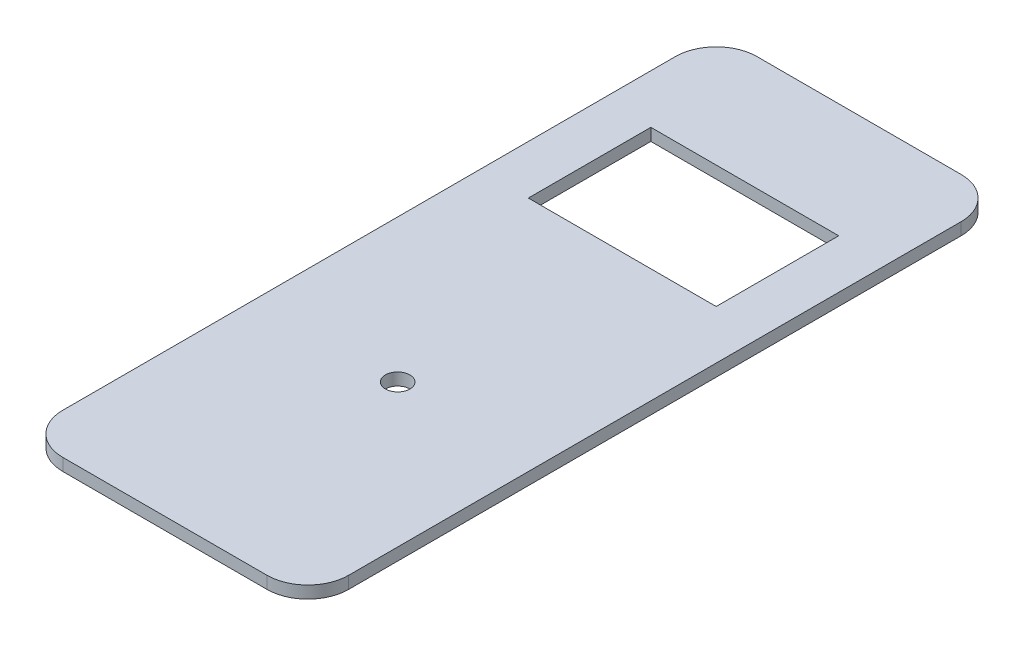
ISO-10303-21;
HEADER;
FILE_DESCRIPTION(('STEP AP214'),'2;1');
FILE_NAME('part.step','',(''),(''),'','','');
FILE_SCHEMA(('AUTOMOTIVE_DESIGN { 1 0 10303 214 1 1 1 1 }'));
ENDSEC;
DATA;
#1=APPLICATION_CONTEXT('core data for automotive mechanical design processes');
#2=APPLICATION_PROTOCOL_DEFINITION('international standard','automotive_design',2000,#1);
#3=PRODUCT_CONTEXT('',#1,'mechanical');
#4=PRODUCT('Part','Part','',(#3));
#5=PRODUCT_RELATED_PRODUCT_CATEGORY('part','',(#4));
#6=PRODUCT_DEFINITION_FORMATION('','',#4);
#7=PRODUCT_DEFINITION_CONTEXT('part definition',#1,'design');
#8=PRODUCT_DEFINITION('design','',#6,#7);
#9=PRODUCT_DEFINITION_SHAPE('','',#8);
#10=(LENGTH_UNIT() NAMED_UNIT(*) SI_UNIT(.MILLI.,.METRE.));
#11=(NAMED_UNIT(*) PLANE_ANGLE_UNIT() SI_UNIT($,.RADIAN.));
#12=(NAMED_UNIT(*) SI_UNIT($,.STERADIAN.) SOLID_ANGLE_UNIT());
#13=UNCERTAINTY_MEASURE_WITH_UNIT(LENGTH_MEASURE(1.E-05),#10,'distance_accuracy_value','');
#14=(GEOMETRIC_REPRESENTATION_CONTEXT(3) GLOBAL_UNCERTAINTY_ASSIGNED_CONTEXT((#13)) GLOBAL_UNIT_ASSIGNED_CONTEXT((#10,
#11,#12)) REPRESENTATION_CONTEXT('',''));
#15=CARTESIAN_POINT('',(0.,0.,0.));
#16=DIRECTION('',(0.,0.,1.));
#17=DIRECTION('',(1.,0.,0.));
#18=AXIS2_PLACEMENT_3D('',#15,#16,#17);
#19=CARTESIAN_POINT('',(0.,1.5,0.));
#20=DIRECTION('',(0.,1.,0.));
#21=DIRECTION('',(0.,0.,1.));
#22=AXIS2_PLACEMENT_3D('',#19,#20,#21);
#23=PLANE('',#22);
#24=DIRECTION('',(1.,0.,0.));
#25=VECTOR('',#24,1.);
#26=CARTESIAN_POINT('',(-11.5,1.5,29.));
#27=LINE('',#26,#25);
#28=CARTESIAN_POINT('',(-11.5,1.5,29.));
#29=VERTEX_POINT('',#28);
#30=CARTESIAN_POINT('',(11.5,1.5,29.));
#31=VERTEX_POINT('',#30);
#32=EDGE_CURVE('E134',#29,#31,#27,.T.);
#33=ORIENTED_EDGE('',*,*,#32,.F.);
#34=DIRECTION('',(0.,0.,1.));
#35=VECTOR('',#34,1.);
#36=CARTESIAN_POINT('',(-11.5,1.5,14.));
#37=LINE('',#36,#35);
#38=CARTESIAN_POINT('',(-11.5,1.5,14.));
#39=VERTEX_POINT('',#38);
#40=EDGE_CURVE('E124',#39,#29,#37,.T.);
#41=ORIENTED_EDGE('',*,*,#40,.F.);
#42=DIRECTION('',(-1.,0.,0.));
#43=VECTOR('',#42,1.);
#44=CARTESIAN_POINT('',(-11.5,1.5,14.));
#45=LINE('',#44,#43);
#46=CARTESIAN_POINT('',(11.5,1.5,14.));
#47=VERTEX_POINT('',#46);
#48=EDGE_CURVE('E149',#47,#39,#45,.T.);
#49=ORIENTED_EDGE('',*,*,#48,.F.);
#50=DIRECTION('',(0.,0.,-1.));
#51=VECTOR('',#50,1.);
#52=CARTESIAN_POINT('',(11.5,1.5,14.));
#53=LINE('',#52,#51);
#54=EDGE_CURVE('E147',#31,#47,#53,.T.);
#55=ORIENTED_EDGE('',*,*,#54,.F.);
#56=EDGE_LOOP('',(#33,#41,#49,#55));
#57=FACE_BOUND('',#56,.T.);
#58=DIRECTION('',(0.,0.,-1.));
#59=VECTOR('',#58,1.);
#60=CARTESIAN_POINT('',(17.5,1.5,0.));
#61=LINE('',#60,#59);
#62=CARTESIAN_POINT('',(17.5,1.5,80.));
#63=VERTEX_POINT('',#62);
#64=CARTESIAN_POINT('',(17.5,1.5,5.));
#65=VERTEX_POINT('',#64);
#66=EDGE_CURVE('E172',#63,#65,#61,.T.);
#67=ORIENTED_EDGE('',*,*,#66,.T.);
#68=CARTESIAN_POINT('',(12.5,1.5,5.));
#69=DIRECTION('',(0.,1.,0.));
#70=DIRECTION('',(0.,0.,1.));
#71=AXIS2_PLACEMENT_3D('',#68,#69,#70);
#72=CIRCLE('',#71,5.);
#73=CARTESIAN_POINT('',(12.5,1.5,0.));
#74=VERTEX_POINT('',#73);
#75=EDGE_CURVE('E210',#65,#74,#72,.T.);
#76=ORIENTED_EDGE('',*,*,#75,.T.);
#77=DIRECTION('',(-1.,0.,0.));
#78=VECTOR('',#77,1.);
#79=CARTESIAN_POINT('',(-17.5,1.5,0.));
#80=LINE('',#79,#78);
#81=CARTESIAN_POINT('',(-12.5,1.5,0.));
#82=VERTEX_POINT('',#81);
#83=EDGE_CURVE('E175',#74,#82,#80,.T.);
#84=ORIENTED_EDGE('',*,*,#83,.T.);
#85=CARTESIAN_POINT('',(-12.5,1.5,5.));
#86=DIRECTION('',(0.,1.,0.));
#87=DIRECTION('',(0.,0.,1.));
#88=AXIS2_PLACEMENT_3D('',#85,#86,#87);
#89=CIRCLE('',#88,5.);
#90=CARTESIAN_POINT('',(-17.5,1.5,5.));
#91=VERTEX_POINT('',#90);
#92=EDGE_CURVE('E208',#82,#91,#89,.T.);
#93=ORIENTED_EDGE('',*,*,#92,.T.);
#94=DIRECTION('',(0.,0.,1.));
#95=VECTOR('',#94,1.);
#96=CARTESIAN_POINT('',(-17.5,1.5,0.));
#97=LINE('',#96,#95);
#98=CARTESIAN_POINT('',(-17.5,1.5,80.));
#99=VERTEX_POINT('',#98);
#100=EDGE_CURVE('E167',#91,#99,#97,.T.);
#101=ORIENTED_EDGE('',*,*,#100,.T.);
#102=CARTESIAN_POINT('',(-12.5,1.5,80.));
#103=DIRECTION('',(0.,1.,0.));
#104=DIRECTION('',(0.,0.,1.));
#105=AXIS2_PLACEMENT_3D('',#102,#103,#104);
#106=CIRCLE('',#105,5.);
#107=CARTESIAN_POINT('',(-12.5,1.5,85.));
#108=VERTEX_POINT('',#107);
#109=EDGE_CURVE('E54',#99,#108,#106,.T.);
#110=ORIENTED_EDGE('',*,*,#109,.T.);
#111=DIRECTION('',(1.,0.,0.));
#112=VECTOR('',#111,1.);
#113=CARTESIAN_POINT('',(-17.5,1.5,85.));
#114=LINE('',#113,#112);
#115=CARTESIAN_POINT('',(12.5,1.5,85.));
#116=VERTEX_POINT('',#115);
#117=EDGE_CURVE('E169',#108,#116,#114,.T.);
#118=ORIENTED_EDGE('',*,*,#117,.T.);
#119=CARTESIAN_POINT('',(12.5,1.5,80.));
#120=DIRECTION('',(0.,1.,0.));
#121=DIRECTION('',(0.,0.,1.));
#122=AXIS2_PLACEMENT_3D('',#119,#120,#121);
#123=CIRCLE('',#122,5.);
#124=EDGE_CURVE('E205',#116,#63,#123,.T.);
#125=ORIENTED_EDGE('',*,*,#124,.T.);
#126=EDGE_LOOP('',(#67,#76,#84,#93,#101,#110,#118,#125));
#127=FACE_BOUND('',#126,.T.);
#128=CARTESIAN_POINT('',(0.,1.5,56.5));
#129=DIRECTION('',(0.,1.,0.));
#130=DIRECTION('',(0.,0.,1.));
#131=AXIS2_PLACEMENT_3D('',#128,#129,#130);
#132=CIRCLE('',#131,1.5);
#133=CARTESIAN_POINT('',(0.,1.5,58.));
#134=VERTEX_POINT('',#133);
#135=EDGE_CURVE('E156',#134,#134,#132,.T.);
#136=ORIENTED_EDGE('',*,*,#135,.F.);
#137=EDGE_LOOP('',(#136));
#138=FACE_BOUND('',#137,.T.);
#139=ADVANCED_FACE('F33',(#57,#127,#138),#23,.T.);
#140=CARTESIAN_POINT('',(0.,0.,0.));
#141=DIRECTION('',(0.,1.,0.));
#142=DIRECTION('',(0.,0.,1.));
#143=AXIS2_PLACEMENT_3D('',#140,#141,#142);
#144=PLANE('',#143);
#145=DIRECTION('',(0.,0.,1.));
#146=VECTOR('',#145,1.);
#147=CARTESIAN_POINT('',(-11.5,0.,14.));
#148=LINE('',#147,#146);
#149=CARTESIAN_POINT('',(-11.5,0.,14.));
#150=VERTEX_POINT('',#149);
#151=CARTESIAN_POINT('',(-11.5,0.,29.));
#152=VERTEX_POINT('',#151);
#153=EDGE_CURVE('E154',#150,#152,#148,.T.);
#154=ORIENTED_EDGE('',*,*,#153,.T.);
#155=DIRECTION('',(1.,0.,0.));
#156=VECTOR('',#155,1.);
#157=CARTESIAN_POINT('',(-11.5,0.,29.));
#158=LINE('',#157,#156);
#159=CARTESIAN_POINT('',(11.5,0.,29.));
#160=VERTEX_POINT('',#159);
#161=EDGE_CURVE('E141',#152,#160,#158,.T.);
#162=ORIENTED_EDGE('',*,*,#161,.T.);
#163=DIRECTION('',(0.,0.,-1.));
#164=VECTOR('',#163,1.);
#165=CARTESIAN_POINT('',(11.5,0.,14.));
#166=LINE('',#165,#164);
#167=CARTESIAN_POINT('',(11.5,0.,14.));
#168=VERTEX_POINT('',#167);
#169=EDGE_CURVE('E158',#160,#168,#166,.T.);
#170=ORIENTED_EDGE('',*,*,#169,.T.);
#171=DIRECTION('',(-1.,0.,0.));
#172=VECTOR('',#171,1.);
#173=CARTESIAN_POINT('',(-11.5,0.,14.));
#174=LINE('',#173,#172);
#175=EDGE_CURVE('E135',#168,#150,#174,.T.);
#176=ORIENTED_EDGE('',*,*,#175,.T.);
#177=EDGE_LOOP('',(#154,#162,#170,#176));
#178=FACE_BOUND('',#177,.T.);
#179=DIRECTION('',(-1.,0.,0.));
#180=VECTOR('',#179,1.);
#181=CARTESIAN_POINT('',(-17.5,0.,0.));
#182=LINE('',#181,#180);
#183=CARTESIAN_POINT('',(12.5,0.,0.));
#184=VERTEX_POINT('',#183);
#185=CARTESIAN_POINT('',(-12.5,0.,0.));
#186=VERTEX_POINT('',#185);
#187=EDGE_CURVE('E170',#184,#186,#182,.T.);
#188=ORIENTED_EDGE('',*,*,#187,.F.);
#189=CARTESIAN_POINT('',(12.5,0.,5.));
#190=DIRECTION('',(0.,1.,0.));
#191=DIRECTION('',(0.,0.,1.));
#192=AXIS2_PLACEMENT_3D('',#189,#190,#191);
#193=CIRCLE('',#192,5.);
#194=CARTESIAN_POINT('',(17.5,0.,5.));
#195=VERTEX_POINT('',#194);
#196=EDGE_CURVE('E198',#184,#195,#193,.F.);
#197=ORIENTED_EDGE('',*,*,#196,.T.);
#198=DIRECTION('',(0.,0.,-1.));
#199=VECTOR('',#198,1.);
#200=CARTESIAN_POINT('',(17.5,0.,0.));
#201=LINE('',#200,#199);
#202=CARTESIAN_POINT('',(17.5,0.,80.));
#203=VERTEX_POINT('',#202);
#204=EDGE_CURVE('E183',#203,#195,#201,.T.);
#205=ORIENTED_EDGE('',*,*,#204,.F.);
#206=CARTESIAN_POINT('',(12.5,0.,80.));
#207=DIRECTION('',(0.,1.,0.));
#208=DIRECTION('',(0.,0.,1.));
#209=AXIS2_PLACEMENT_3D('',#206,#207,#208);
#210=CIRCLE('',#209,5.);
#211=CARTESIAN_POINT('',(12.5,0.,85.));
#212=VERTEX_POINT('',#211);
#213=EDGE_CURVE('E192',#203,#212,#210,.F.);
#214=ORIENTED_EDGE('',*,*,#213,.T.);
#215=DIRECTION('',(1.,0.,0.));
#216=VECTOR('',#215,1.);
#217=CARTESIAN_POINT('',(-17.5,0.,85.));
#218=LINE('',#217,#216);
#219=CARTESIAN_POINT('',(-12.5,0.,85.));
#220=VERTEX_POINT('',#219);
#221=EDGE_CURVE('E181',#220,#212,#218,.T.);
#222=ORIENTED_EDGE('',*,*,#221,.F.);
#223=CARTESIAN_POINT('',(-12.5,0.,80.));
#224=DIRECTION('',(0.,1.,0.));
#225=DIRECTION('',(0.,0.,1.));
#226=AXIS2_PLACEMENT_3D('',#223,#224,#225);
#227=CIRCLE('',#226,5.);
#228=CARTESIAN_POINT('',(-17.5,0.,80.));
#229=VERTEX_POINT('',#228);
#230=EDGE_CURVE('E194',#220,#229,#227,.F.);
#231=ORIENTED_EDGE('',*,*,#230,.T.);
#232=DIRECTION('',(0.,0.,1.));
#233=VECTOR('',#232,1.);
#234=CARTESIAN_POINT('',(-17.5,0.,0.));
#235=LINE('',#234,#233);
#236=CARTESIAN_POINT('',(-17.5,0.,5.));
#237=VERTEX_POINT('',#236);
#238=EDGE_CURVE('E142',#237,#229,#235,.T.);
#239=ORIENTED_EDGE('',*,*,#238,.F.);
#240=CARTESIAN_POINT('',(-12.5,0.,5.));
#241=DIRECTION('',(0.,1.,0.));
#242=DIRECTION('',(0.,0.,1.));
#243=AXIS2_PLACEMENT_3D('',#240,#241,#242);
#244=CIRCLE('',#243,5.);
#245=EDGE_CURVE('E196',#237,#186,#244,.F.);
#246=ORIENTED_EDGE('',*,*,#245,.T.);
#247=EDGE_LOOP('',(#188,#197,#205,#214,#222,#231,#239,#246));
#248=FACE_BOUND('',#247,.T.);
#249=CARTESIAN_POINT('',(0.,0.,56.5));
#250=DIRECTION('',(0.,1.,0.));
#251=DIRECTION('',(0.,0.,1.));
#252=AXIS2_PLACEMENT_3D('',#249,#250,#251);
#253=CIRCLE('',#252,1.5);
#254=CARTESIAN_POINT('',(0.,0.,58.));
#255=VERTEX_POINT('',#254);
#256=EDGE_CURVE('E381',#255,#255,#253,.T.);
#257=ORIENTED_EDGE('',*,*,#256,.T.);
#258=EDGE_LOOP('',(#257));
#259=FACE_BOUND('',#258,.T.);
#260=ADVANCED_FACE('F226',(#178,#248,#259),#144,.F.);
#261=CARTESIAN_POINT('',(-17.5,1.5,0.));
#262=DIRECTION('',(1.,0.,0.));
#263=DIRECTION('',(0.,0.,-1.));
#264=AXIS2_PLACEMENT_3D('',#261,#262,#263);
#265=PLANE('',#264);
#266=ORIENTED_EDGE('',*,*,#100,.F.);
#267=DIRECTION('',(0.,-1.,0.));
#268=VECTOR('',#267,1.);
#269=CARTESIAN_POINT('',(-17.5,1.5,5.));
#270=LINE('',#269,#268);
#271=EDGE_CURVE('E214',#91,#237,#270,.T.);
#272=ORIENTED_EDGE('',*,*,#271,.T.);
#273=ORIENTED_EDGE('',*,*,#238,.T.);
#274=DIRECTION('',(0.,-1.,0.));
#275=VECTOR('',#274,1.);
#276=CARTESIAN_POINT('',(-17.5,1.5,80.));
#277=LINE('',#276,#275);
#278=EDGE_CURVE('E212',#229,#99,#277,.F.);
#279=ORIENTED_EDGE('',*,*,#278,.T.);
#280=EDGE_LOOP('',(#266,#272,#273,#279));
#281=FACE_BOUND('',#280,.T.);
#282=ADVANCED_FACE('F220',(#281),#265,.F.);
#283=CARTESIAN_POINT('',(-17.5,1.5,85.));
#284=DIRECTION('',(0.,0.,-1.));
#285=DIRECTION('',(-1.,0.,0.));
#286=AXIS2_PLACEMENT_3D('',#283,#284,#285);
#287=PLANE('',#286);
#288=ORIENTED_EDGE('',*,*,#117,.F.);
#289=DIRECTION('',(0.,-1.,0.));
#290=VECTOR('',#289,1.);
#291=CARTESIAN_POINT('',(-12.5,1.5,85.));
#292=LINE('',#291,#290);
#293=EDGE_CURVE('E11',#108,#220,#292,.T.);
#294=ORIENTED_EDGE('',*,*,#293,.T.);
#295=ORIENTED_EDGE('',*,*,#221,.T.);
#296=DIRECTION('',(0.,-1.,0.));
#297=VECTOR('',#296,1.);
#298=CARTESIAN_POINT('',(12.5,1.5,85.));
#299=LINE('',#298,#297);
#300=EDGE_CURVE('E41',#212,#116,#299,.F.);
#301=ORIENTED_EDGE('',*,*,#300,.T.);
#302=EDGE_LOOP('',(#288,#294,#295,#301));
#303=FACE_BOUND('',#302,.T.);
#304=ADVANCED_FACE('F232',(#303),#287,.F.);
#305=CARTESIAN_POINT('',(17.5,1.5,0.));
#306=DIRECTION('',(-1.,0.,0.));
#307=DIRECTION('',(0.,0.,1.));
#308=AXIS2_PLACEMENT_3D('',#305,#306,#307);
#309=PLANE('',#308);
#310=ORIENTED_EDGE('',*,*,#204,.T.);
#311=DIRECTION('',(0.,-1.,0.));
#312=VECTOR('',#311,1.);
#313=CARTESIAN_POINT('',(17.5,1.5,5.));
#314=LINE('',#313,#312);
#315=EDGE_CURVE('E203',#195,#65,#314,.F.);
#316=ORIENTED_EDGE('',*,*,#315,.T.);
#317=ORIENTED_EDGE('',*,*,#66,.F.);
#318=DIRECTION('',(0.,-1.,0.));
#319=VECTOR('',#318,1.);
#320=CARTESIAN_POINT('',(17.5,1.5,80.));
#321=LINE('',#320,#319);
#322=EDGE_CURVE('E200',#63,#203,#321,.T.);
#323=ORIENTED_EDGE('',*,*,#322,.T.);
#324=EDGE_LOOP('',(#310,#316,#317,#323));
#325=FACE_BOUND('',#324,.T.);
#326=ADVANCED_FACE('F240',(#325),#309,.F.);
#327=CARTESIAN_POINT('',(-17.5,1.5,0.));
#328=DIRECTION('',(0.,0.,1.));
#329=DIRECTION('',(1.,0.,0.));
#330=AXIS2_PLACEMENT_3D('',#327,#328,#329);
#331=PLANE('',#330);
#332=ORIENTED_EDGE('',*,*,#83,.F.);
#333=DIRECTION('',(0.,-1.,0.));
#334=VECTOR('',#333,1.);
#335=CARTESIAN_POINT('',(12.5,1.5,0.));
#336=LINE('',#335,#334);
#337=EDGE_CURVE('E189',#74,#184,#336,.T.);
#338=ORIENTED_EDGE('',*,*,#337,.T.);
#339=ORIENTED_EDGE('',*,*,#187,.T.);
#340=DIRECTION('',(0.,-1.,0.));
#341=VECTOR('',#340,1.);
#342=CARTESIAN_POINT('',(-12.5,1.5,0.));
#343=LINE('',#342,#341);
#344=EDGE_CURVE('E178',#186,#82,#343,.F.);
#345=ORIENTED_EDGE('',*,*,#344,.T.);
#346=EDGE_LOOP('',(#332,#338,#339,#345));
#347=FACE_BOUND('',#346,.T.);
#348=ADVANCED_FACE('F248',(#347),#331,.F.);
#349=CARTESIAN_POINT('',(-11.5,1.5,14.));
#350=DIRECTION('',(1.,0.,0.));
#351=DIRECTION('',(0.,0.,-1.));
#352=AXIS2_PLACEMENT_3D('',#349,#350,#351);
#353=PLANE('',#352);
#354=ORIENTED_EDGE('',*,*,#153,.F.);
#355=DIRECTION('',(0.,-1.,0.));
#356=VECTOR('',#355,1.);
#357=CARTESIAN_POINT('',(-11.5,1.5,14.));
#358=LINE('',#357,#356);
#359=EDGE_CURVE('E130',#39,#150,#358,.T.);
#360=ORIENTED_EDGE('',*,*,#359,.F.);
#361=ORIENTED_EDGE('',*,*,#40,.T.);
#362=DIRECTION('',(0.,-1.,0.));
#363=VECTOR('',#362,1.);
#364=CARTESIAN_POINT('',(-11.5,1.5,29.));
#365=LINE('',#364,#363);
#366=EDGE_CURVE('E127',#29,#152,#365,.T.);
#367=ORIENTED_EDGE('',*,*,#366,.T.);
#368=EDGE_LOOP('',(#354,#360,#361,#367));
#369=FACE_BOUND('',#368,.T.);
#370=ADVANCED_FACE('F126',(#369),#353,.T.);
#371=CARTESIAN_POINT('',(-11.5,1.5,29.));
#372=DIRECTION('',(0.,0.,-1.));
#373=DIRECTION('',(-1.,0.,0.));
#374=AXIS2_PLACEMENT_3D('',#371,#372,#373);
#375=PLANE('',#374);
#376=ORIENTED_EDGE('',*,*,#161,.F.);
#377=ORIENTED_EDGE('',*,*,#366,.F.);
#378=ORIENTED_EDGE('',*,*,#32,.T.);
#379=DIRECTION('',(0.,-1.,0.));
#380=VECTOR('',#379,1.);
#381=CARTESIAN_POINT('',(11.5,1.5,29.));
#382=LINE('',#381,#380);
#383=EDGE_CURVE('E143',#31,#160,#382,.T.);
#384=ORIENTED_EDGE('',*,*,#383,.T.);
#385=EDGE_LOOP('',(#376,#377,#378,#384));
#386=FACE_BOUND('',#385,.T.);
#387=ADVANCED_FACE('F138',(#386),#375,.T.);
#388=CARTESIAN_POINT('',(11.5,1.5,14.));
#389=DIRECTION('',(-1.,0.,0.));
#390=DIRECTION('',(0.,0.,1.));
#391=AXIS2_PLACEMENT_3D('',#388,#389,#390);
#392=PLANE('',#391);
#393=ORIENTED_EDGE('',*,*,#169,.F.);
#394=ORIENTED_EDGE('',*,*,#383,.F.);
#395=ORIENTED_EDGE('',*,*,#54,.T.);
#396=DIRECTION('',(0.,-1.,0.));
#397=VECTOR('',#396,1.);
#398=CARTESIAN_POINT('',(11.5,1.5,14.));
#399=LINE('',#398,#397);
#400=EDGE_CURVE('E164',#47,#168,#399,.T.);
#401=ORIENTED_EDGE('',*,*,#400,.T.);
#402=EDGE_LOOP('',(#393,#394,#395,#401));
#403=FACE_BOUND('',#402,.T.);
#404=ADVANCED_FACE('F304',(#403),#392,.T.);
#405=CARTESIAN_POINT('',(-11.5,1.5,14.));
#406=DIRECTION('',(0.,0.,1.));
#407=DIRECTION('',(1.,0.,0.));
#408=AXIS2_PLACEMENT_3D('',#405,#406,#407);
#409=PLANE('',#408);
#410=ORIENTED_EDGE('',*,*,#175,.F.);
#411=ORIENTED_EDGE('',*,*,#400,.F.);
#412=ORIENTED_EDGE('',*,*,#48,.T.);
#413=ORIENTED_EDGE('',*,*,#359,.T.);
#414=EDGE_LOOP('',(#410,#411,#412,#413));
#415=FACE_BOUND('',#414,.T.);
#416=ADVANCED_FACE('F310',(#415),#409,.T.);
#417=CARTESIAN_POINT('',(0.,1.5,56.5));
#418=DIRECTION('',(0.,-1.,0.));
#419=DIRECTION('',(0.,0.,-1.));
#420=AXIS2_PLACEMENT_3D('',#417,#418,#419);
#421=CYLINDRICAL_SURFACE('',#420,1.5);
#422=ORIENTED_EDGE('',*,*,#135,.T.);
#423=EDGE_LOOP('',(#422));
#424=FACE_BOUND('',#423,.T.);
#425=ORIENTED_EDGE('',*,*,#256,.F.);
#426=EDGE_LOOP('',(#425));
#427=FACE_BOUND('',#426,.T.);
#428=ADVANCED_FACE('F257',(#424,#427),#421,.F.);
#429=CARTESIAN_POINT('',(12.5,1.5,5.));
#430=DIRECTION('',(0.,-1.,0.));
#431=DIRECTION('',(0.,0.,-1.));
#432=AXIS2_PLACEMENT_3D('',#429,#430,#431);
#433=CYLINDRICAL_SURFACE('',#432,5.);
#434=ORIENTED_EDGE('',*,*,#75,.F.);
#435=ORIENTED_EDGE('',*,*,#315,.F.);
#436=ORIENTED_EDGE('',*,*,#196,.F.);
#437=ORIENTED_EDGE('',*,*,#337,.F.);
#438=EDGE_LOOP('',(#434,#435,#436,#437));
#439=FACE_BOUND('',#438,.T.);
#440=ADVANCED_FACE('F245',(#439),#433,.T.);
#441=CARTESIAN_POINT('',(-12.5,1.5,5.));
#442=DIRECTION('',(0.,-1.,0.));
#443=DIRECTION('',(0.,0.,-1.));
#444=AXIS2_PLACEMENT_3D('',#441,#442,#443);
#445=CYLINDRICAL_SURFACE('',#444,5.);
#446=ORIENTED_EDGE('',*,*,#92,.F.);
#447=ORIENTED_EDGE('',*,*,#344,.F.);
#448=ORIENTED_EDGE('',*,*,#245,.F.);
#449=ORIENTED_EDGE('',*,*,#271,.F.);
#450=EDGE_LOOP('',(#446,#447,#448,#449));
#451=FACE_BOUND('',#450,.T.);
#452=ADVANCED_FACE('F250',(#451),#445,.T.);
#453=CARTESIAN_POINT('',(-12.5,1.5,80.));
#454=DIRECTION('',(0.,-1.,0.));
#455=DIRECTION('',(0.,0.,-1.));
#456=AXIS2_PLACEMENT_3D('',#453,#454,#455);
#457=CYLINDRICAL_SURFACE('',#456,5.);
#458=ORIENTED_EDGE('',*,*,#109,.F.);
#459=ORIENTED_EDGE('',*,*,#278,.F.);
#460=ORIENTED_EDGE('',*,*,#230,.F.);
#461=ORIENTED_EDGE('',*,*,#293,.F.);
#462=EDGE_LOOP('',(#458,#459,#460,#461));
#463=FACE_BOUND('',#462,.T.);
#464=ADVANCED_FACE('F231',(#463),#457,.T.);
#465=CARTESIAN_POINT('',(12.5,1.5,80.));
#466=DIRECTION('',(0.,-1.,0.));
#467=DIRECTION('',(0.,0.,-1.));
#468=AXIS2_PLACEMENT_3D('',#465,#466,#467);
#469=CYLINDRICAL_SURFACE('',#468,5.);
#470=ORIENTED_EDGE('',*,*,#124,.F.);
#471=ORIENTED_EDGE('',*,*,#300,.F.);
#472=ORIENTED_EDGE('',*,*,#213,.F.);
#473=ORIENTED_EDGE('',*,*,#322,.F.);
#474=EDGE_LOOP('',(#470,#471,#472,#473));
#475=FACE_BOUND('',#474,.T.);
#476=ADVANCED_FACE('F35',(#475),#469,.T.);
#477=CLOSED_SHELL('',(#139,#260,#282,#304,#326,#348,#370,#387,#404,#416,#428,#440,#452,#464,#476));
#478=MANIFOLD_SOLID_BREP('B2',#477);
#479=ADVANCED_BREP_SHAPE_REPRESENTATION('',(#18,#478),#14);
#480=SHAPE_DEFINITION_REPRESENTATION(#9,#479);
ENDSEC;
END-ISO-10303-21;
